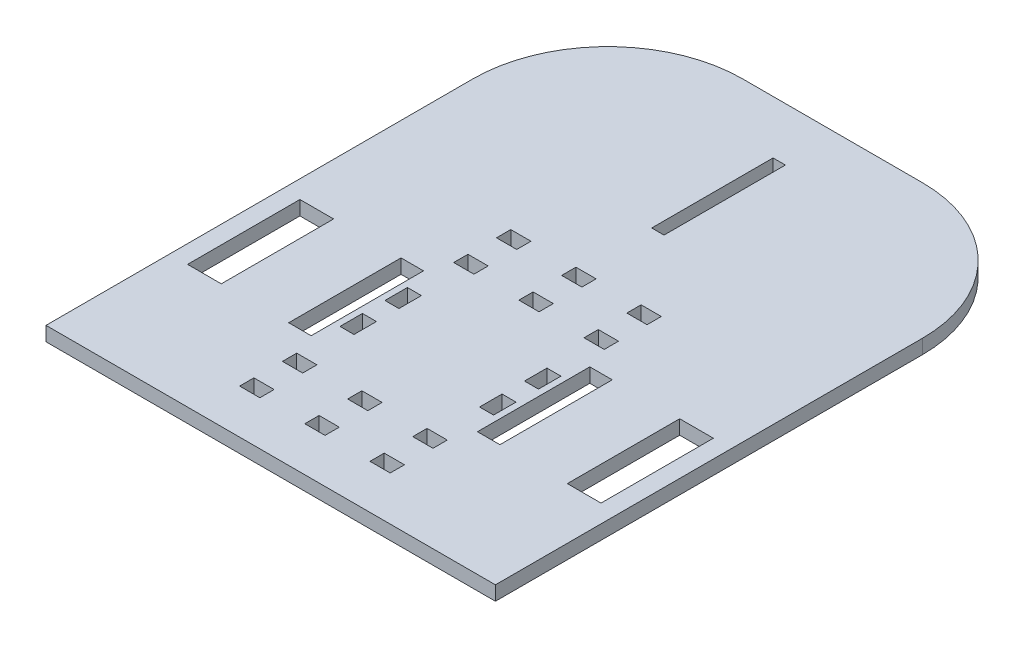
from build123d import *

# Parameters (mm, degrees)
SKETCH1_W           = 200
SKETCH1_H           = 250
SKETCH1_W_2         = 5.4862609
SKETCH1_H_2         = 53.998630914
SKETCH1_W_3         = 6.227340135
SKETCH1_H_3         = 10
SKETCH1_W_4         = 9
SKETCH1_H_4         = 6.349855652
SKETCH1_H_5         = 6.350070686
SKETCH1_W_5         = 15
SKETCH1_H_6         = 50
SKETCH1_H_7         = 6.349855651
SKETCH1_W_6         = 10
BOSS_EXTRUDE1_DEPTH = 6.35
FILLET1_R           = 60


with BuildPart() as part:
    # Sketch1 → Boss-Extrude1 (new body)
    with BuildSketch(Plane(origin=(0, 0, 0), x_dir=(1, 0, 0), z_dir=(0, 1, 0))):
        Rectangle(SKETCH1_W, SKETCH1_H)
        with Locations((0, 74.300529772)):
            Rectangle(SKETCH1_W_2, SKETCH1_H_2, mode=Mode.SUBTRACT)
        with Locations((31.053670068, -55)):
            Rectangle(SKETCH1_W_3, SKETCH1_H_3, mode=Mode.SUBTRACT)
        with Locations((31.053670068, -35)):
            Rectangle(SKETCH1_W_3, SKETCH1_H_3, mode=Mode.SUBTRACT)
        with Locations((0, -83.1)):
            Rectangle(SKETCH1_W_4, SKETCH1_H_4, mode=Mode.SUBTRACT)
        with Locations((-31.053670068, -55)):
            Rectangle(SKETCH1_W_3, SKETCH1_H_3, mode=Mode.SUBTRACT)
        with Locations((-31.053670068, -35)):
            Rectangle(SKETCH1_W_3, SKETCH1_H_3, mode=Mode.SUBTRACT)
        with Locations((29, -83.1)):
            Rectangle(SKETCH1_W_4, SKETCH1_H_5, mode=Mode.SUBTRACT)
        with Locations((-84.5, -45)):
            Rectangle(SKETCH1_W_5, SKETCH1_H_6, mode=Mode.SUBTRACT)
        with Locations((-29, -83.1)):
            Rectangle(SKETCH1_W_4, SKETCH1_H_5, mode=Mode.SUBTRACT)
        with Locations((29, -102.149855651)):
            Rectangle(SKETCH1_W_4, SKETCH1_H_5, mode=Mode.SUBTRACT)
        with Locations((0, -102.149855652)):
            Rectangle(SKETCH1_W_4, SKETCH1_H_7, mode=Mode.SUBTRACT)
        with Locations((-29, -102.149855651)):
            Rectangle(SKETCH1_W_4, SKETCH1_H_5, mode=Mode.SUBTRACT)
        with Locations((0, -6.9)):
            Rectangle(SKETCH1_W_4, SKETCH1_H_4, mode=Mode.SUBTRACT)
        with Locations((29, -6.9)):
            Rectangle(SKETCH1_W_4, SKETCH1_H_5, mode=Mode.SUBTRACT)
        with Locations((29, 12.149855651)):
            Rectangle(SKETCH1_W_4, SKETCH1_H_5, mode=Mode.SUBTRACT)
        with Locations((0, 12.149855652)):
            Rectangle(SKETCH1_W_4, SKETCH1_H_7, mode=Mode.SUBTRACT)
        with Locations((-29, 12.149855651)):
            Rectangle(SKETCH1_W_4, SKETCH1_H_5, mode=Mode.SUBTRACT)
        with Locations((-29, -6.9)):
            Rectangle(SKETCH1_W_4, SKETCH1_H_5, mode=Mode.SUBTRACT)
        with Locations((-42, -45)):
            Rectangle(SKETCH1_W_6, SKETCH1_H_6, mode=Mode.SUBTRACT)
        with Locations((84.5, -45)):
            Rectangle(SKETCH1_W_5, SKETCH1_H_6, mode=Mode.SUBTRACT)
        with Locations((42, -45)):
            Rectangle(SKETCH1_W_6, SKETCH1_H_6, mode=Mode.SUBTRACT)
    extrude(amount=BOSS_EXTRUDE1_DEPTH)

    # Fillet1
    fillet1_edges = [part.edges().sort_by_distance(p)[0] for p in [
        (-100, 3.175, -125),
        (100, 3.175, -125),
    ]]
    fillet(fillet1_edges, radius=FILLET1_R)


solid = part.part
